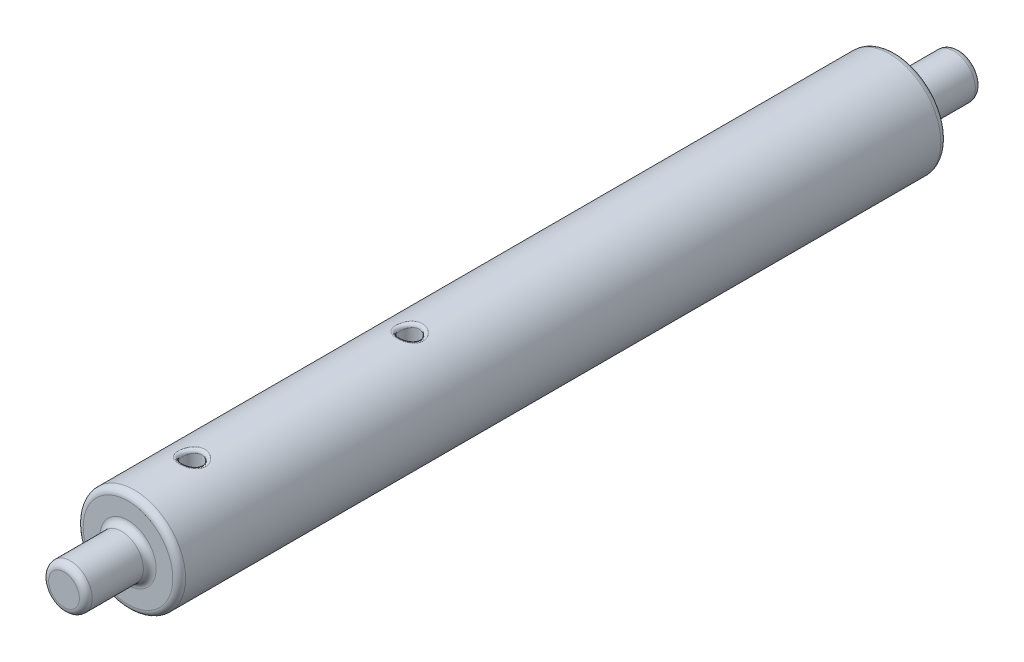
from build123d import *

# Parameters (mm, degrees)
FILLET_1_R          = 0.5
SKETCH_2_R          = 0.75
CUT_EXTRUDE_1_DEPTH = 5
FILLET_2_R          = 0.25


with BuildPart() as part:
    # Sketch 1 → Revolve 1 (revolve)
    with BuildSketch(Plane(origin=(0, 0, 0), x_dir=(0, 0, -1), z_dir=(1, 0, 0)), mode=Mode.PRIVATE) as revolve_1_sk:
        Polygon((-35, 0), (35, 0), (35, 1.7), (30, 1.7), (30, 4), (-30, 4), (-30, 1.7), (-35, 1.7), align=None)
    revolve(revolve_1_sk.sketch.rotate(Axis((0, 0, 35), (0, 0, -1)), 90), axis=Axis((0, 0, 35), (0, 0, -1)))

    # Fillet 1
    fillet_1_edges = [part.edges().sort_by_distance(p)[0] for p in [
        (-1.7, 0, 35),
        (-1.7, 0, 30),
        (-4, 0, 30),
        (-4, 0, -30),
        (-1.7, 0, -30),
        (-1.7, 0, -35),
    ]]
    fillet(fillet_1_edges, radius=FILLET_1_R)

    # Sketch 2 → Cut-Extrude 1 (cut, symmetric)
    with BuildSketch(Plane(origin=(0, 0, 0), x_dir=(1, 0, 0), z_dir=(0, 1, 0))):
        with Locations(Location((0, -25, 0), (0, 0, 270))):
            Circle(SKETCH_2_R)
        with Locations(Location((0, -8, 0), (0, 0, 270))):
            Circle(SKETCH_2_R)
    extrude(amount=CUT_EXTRUDE_1_DEPTH, both=True, mode=Mode.SUBTRACT)

    # Fillet 2
    fillet_2_edges = [part.edges().sort_by_distance(p)[0] for p in [
        (0, 4, 24.25),
        (0, -4, 24.25),
        (0, 4.000000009, 7.25000001),
        (0, -4.000000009, 7.25000001),
    ]]
    fillet(fillet_2_edges, radius=FILLET_2_R)


solid = part.part
